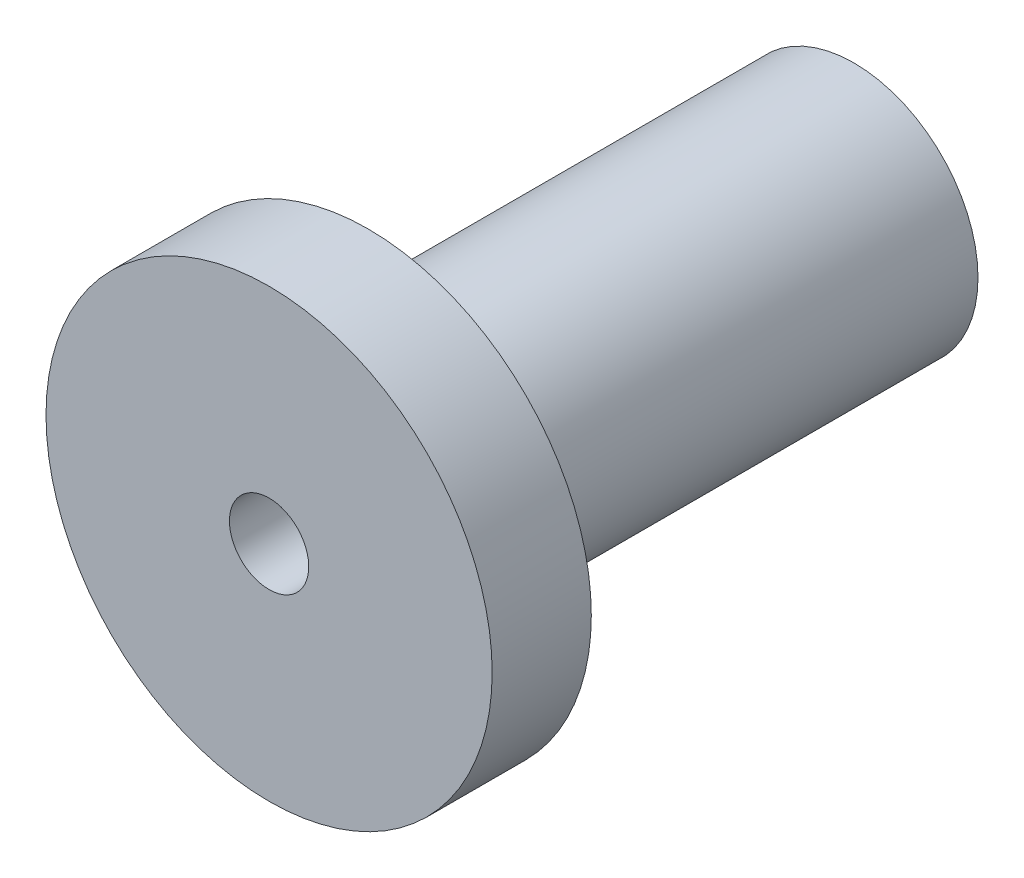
ISO-10303-21;
HEADER;
FILE_DESCRIPTION(('STEP AP214'),'2;1');
FILE_NAME('part.step','',(''),(''),'','','');
FILE_SCHEMA(('AUTOMOTIVE_DESIGN { 1 0 10303 214 1 1 1 1 }'));
ENDSEC;
DATA;
#1=APPLICATION_CONTEXT('core data for automotive mechanical design processes');
#2=APPLICATION_PROTOCOL_DEFINITION('international standard','automotive_design',2000,#1);
#3=PRODUCT_CONTEXT('',#1,'mechanical');
#4=PRODUCT('Part','Part','',(#3));
#5=PRODUCT_RELATED_PRODUCT_CATEGORY('part','',(#4));
#6=PRODUCT_DEFINITION_FORMATION('','',#4);
#7=PRODUCT_DEFINITION_CONTEXT('part definition',#1,'design');
#8=PRODUCT_DEFINITION('design','',#6,#7);
#9=PRODUCT_DEFINITION_SHAPE('','',#8);
#10=(LENGTH_UNIT() NAMED_UNIT(*) SI_UNIT(.MILLI.,.METRE.));
#11=(NAMED_UNIT(*) PLANE_ANGLE_UNIT() SI_UNIT($,.RADIAN.));
#12=(NAMED_UNIT(*) SI_UNIT($,.STERADIAN.) SOLID_ANGLE_UNIT());
#13=UNCERTAINTY_MEASURE_WITH_UNIT(LENGTH_MEASURE(1.E-05),#10,'distance_accuracy_value','');
#14=(GEOMETRIC_REPRESENTATION_CONTEXT(3) GLOBAL_UNCERTAINTY_ASSIGNED_CONTEXT((#13)) GLOBAL_UNIT_ASSIGNED_CONTEXT((#10,
#11,#12)) REPRESENTATION_CONTEXT('',''));
#15=CARTESIAN_POINT('',(0.,0.,0.));
#16=DIRECTION('',(0.,0.,1.));
#17=DIRECTION('',(1.,0.,0.));
#18=AXIS2_PLACEMENT_3D('',#15,#16,#17);
#19=CARTESIAN_POINT('',(0.,0.,-49.));
#20=DIRECTION('',(0.,0.,-1.));
#21=DIRECTION('',(0.,1.,0.));
#22=AXIS2_PLACEMENT_3D('',#19,#20,#21);
#23=PLANE('',#22);
#24=CARTESIAN_POINT('',(0.,0.,-49.));
#25=DIRECTION('',(0.,0.,-1.));
#26=DIRECTION('',(0.,1.,0.));
#27=AXIS2_PLACEMENT_3D('',#24,#25,#26);
#28=CIRCLE('',#27,12.5);
#29=CARTESIAN_POINT('',(0.,12.5,-49.));
#30=VERTEX_POINT('',#29);
#31=EDGE_CURVE('E8',#30,#30,#28,.T.);
#32=ORIENTED_EDGE('',*,*,#31,.T.);
#33=EDGE_LOOP('',(#32));
#34=FACE_BOUND('',#33,.T.);
#35=ADVANCED_FACE('F12',(#34),#23,.T.);
#36=CARTESIAN_POINT('',(0.,0.,-59.));
#37=DIRECTION('',(0.,0.,-1.));
#38=DIRECTION('',(0.,1.,0.));
#39=AXIS2_PLACEMENT_3D('',#36,#37,#38);
#40=CYLINDRICAL_SURFACE('',#39,12.5);
#41=CARTESIAN_POINT('',(0.,0.,0.));
#42=DIRECTION('',(0.,0.,-1.));
#43=DIRECTION('',(0.,1.,0.));
#44=AXIS2_PLACEMENT_3D('',#41,#42,#43);
#45=CIRCLE('',#44,12.5);
#46=CARTESIAN_POINT('',(0.,12.5,0.));
#47=VERTEX_POINT('',#46);
#48=EDGE_CURVE('E18',#47,#47,#45,.T.);
#49=ORIENTED_EDGE('',*,*,#48,.T.);
#50=EDGE_LOOP('',(#49));
#51=FACE_BOUND('',#50,.T.);
#52=ORIENTED_EDGE('',*,*,#31,.F.);
#53=EDGE_LOOP('',(#52));
#54=FACE_BOUND('',#53,.T.);
#55=ADVANCED_FACE('F61',(#51,#54),#40,.T.);
#56=CARTESIAN_POINT('',(12.5,0.,0.));
#57=DIRECTION('',(0.,0.,-1.));
#58=DIRECTION('',(0.,1.,0.));
#59=AXIS2_PLACEMENT_3D('',#56,#57,#58);
#60=PLANE('',#59);
#61=CARTESIAN_POINT('',(0.,0.,0.));
#62=DIRECTION('',(0.,0.,-1.));
#63=DIRECTION('',(0.,1.,0.));
#64=AXIS2_PLACEMENT_3D('',#61,#62,#63);
#65=CIRCLE('',#64,22.5);
#66=CARTESIAN_POINT('',(0.,22.5,0.));
#67=VERTEX_POINT('',#66);
#68=EDGE_CURVE('E22',#67,#67,#65,.T.);
#69=ORIENTED_EDGE('',*,*,#68,.T.);
#70=EDGE_LOOP('',(#69));
#71=FACE_BOUND('',#70,.T.);
#72=ORIENTED_EDGE('',*,*,#48,.F.);
#73=EDGE_LOOP('',(#72));
#74=FACE_BOUND('',#73,.T.);
#75=ADVANCED_FACE('F55',(#71,#74),#60,.T.);
#76=CARTESIAN_POINT('',(0.,0.,-59.));
#77=DIRECTION('',(0.,0.,-1.));
#78=DIRECTION('',(0.,1.,0.));
#79=AXIS2_PLACEMENT_3D('',#76,#77,#78);
#80=CYLINDRICAL_SURFACE('',#79,22.5);
#81=CARTESIAN_POINT('',(0.,0.,10.));
#82=DIRECTION('',(0.,0.,-1.));
#83=DIRECTION('',(0.,1.,0.));
#84=AXIS2_PLACEMENT_3D('',#81,#82,#83);
#85=CIRCLE('',#84,22.5);
#86=CARTESIAN_POINT('',(0.,22.5,10.));
#87=VERTEX_POINT('',#86);
#88=EDGE_CURVE('E26',#87,#87,#85,.T.);
#89=ORIENTED_EDGE('',*,*,#88,.T.);
#90=EDGE_LOOP('',(#89));
#91=FACE_BOUND('',#90,.T.);
#92=ORIENTED_EDGE('',*,*,#68,.F.);
#93=EDGE_LOOP('',(#92));
#94=FACE_BOUND('',#93,.T.);
#95=ADVANCED_FACE('F49',(#91,#94),#80,.T.);
#96=CARTESIAN_POINT('',(22.5,0.,10.));
#97=DIRECTION('',(0.,0.,1.));
#98=DIRECTION('',(0.,-1.,0.));
#99=AXIS2_PLACEMENT_3D('',#96,#97,#98);
#100=PLANE('',#99);
#101=CARTESIAN_POINT('',(0.,0.,10.));
#102=DIRECTION('',(0.,0.,1.));
#103=DIRECTION('',(0.,-1.,0.));
#104=AXIS2_PLACEMENT_3D('',#101,#102,#103);
#105=CIRCLE('',#104,4.);
#106=CARTESIAN_POINT('',(0.,-4.,10.));
#107=VERTEX_POINT('',#106);
#108=EDGE_CURVE('E32',#107,#107,#105,.T.);
#109=ORIENTED_EDGE('',*,*,#108,.F.);
#110=EDGE_LOOP('',(#109));
#111=FACE_BOUND('',#110,.T.);
#112=ORIENTED_EDGE('',*,*,#88,.F.);
#113=EDGE_LOOP('',(#112));
#114=FACE_BOUND('',#113,.T.);
#115=ADVANCED_FACE('F43',(#111,#114),#100,.T.);
#116=CARTESIAN_POINT('',(0.,0.,-29.));
#117=DIRECTION('',(0.,0.,1.));
#118=DIRECTION('',(0.,-1.,0.));
#119=AXIS2_PLACEMENT_3D('',#116,#117,#118);
#120=CYLINDRICAL_SURFACE('',#119,4.);
#121=CARTESIAN_POINT('',(0.,0.,-29.));
#122=DIRECTION('',(0.,0.,1.));
#123=DIRECTION('',(0.,-1.,0.));
#124=AXIS2_PLACEMENT_3D('',#121,#122,#123);
#125=CIRCLE('',#124,4.);
#126=CARTESIAN_POINT('',(0.,-4.,-29.));
#127=VERTEX_POINT('',#126);
#128=EDGE_CURVE('E31',#127,#127,#125,.T.);
#129=ORIENTED_EDGE('',*,*,#128,.F.);
#130=EDGE_LOOP('',(#129));
#131=FACE_BOUND('',#130,.T.);
#132=ORIENTED_EDGE('',*,*,#108,.T.);
#133=EDGE_LOOP('',(#132));
#134=FACE_BOUND('',#133,.T.);
#135=ADVANCED_FACE('F40',(#131,#134),#120,.F.);
#136=CARTESIAN_POINT('',(0.,0.,-29.));
#137=DIRECTION('',(0.,0.,1.));
#138=DIRECTION('',(0.,-1.,0.));
#139=AXIS2_PLACEMENT_3D('',#136,#137,#138);
#140=PLANE('',#139);
#141=ORIENTED_EDGE('',*,*,#128,.T.);
#142=EDGE_LOOP('',(#141));
#143=FACE_BOUND('',#142,.T.);
#144=ADVANCED_FACE('F38',(#143),#140,.T.);
#145=CLOSED_SHELL('',(#35,#55,#75,#95,#115,#135,#144));
#146=MANIFOLD_SOLID_BREP('B1',#145);
#147=ADVANCED_BREP_SHAPE_REPRESENTATION('',(#18,#146),#14);
#148=SHAPE_DEFINITION_REPRESENTATION(#9,#147);
ENDSEC;
END-ISO-10303-21;
